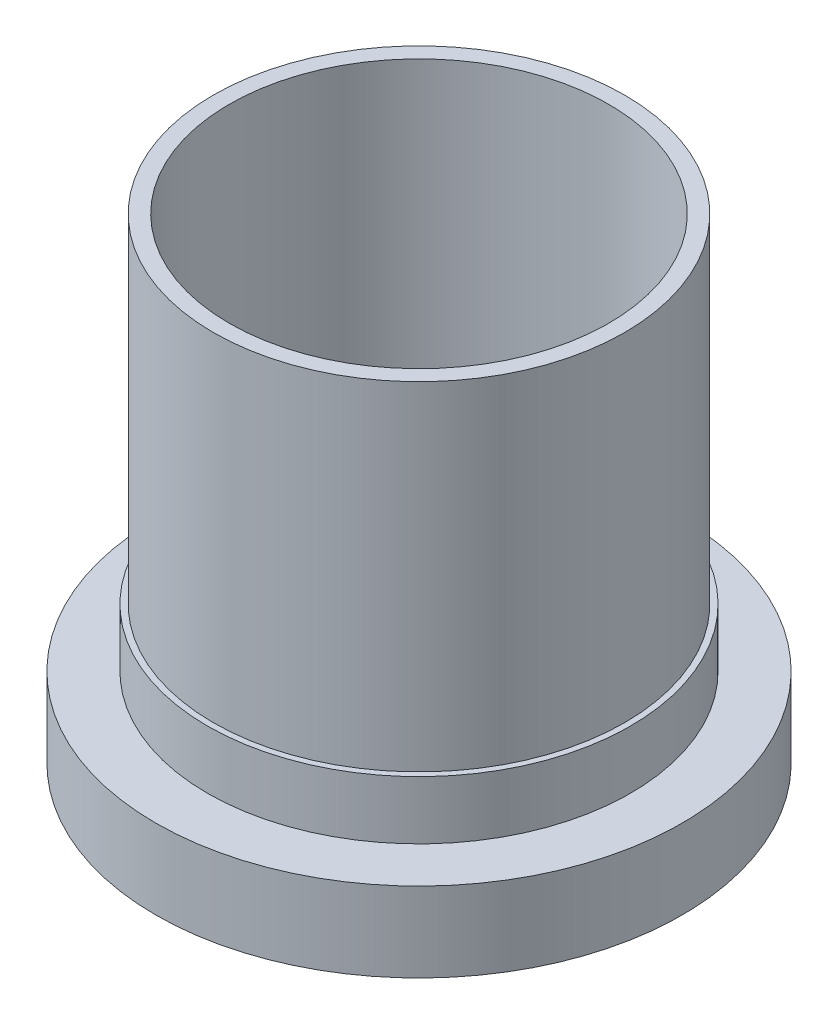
ISO-10303-21;
HEADER;
FILE_DESCRIPTION(('STEP AP214'),'2;1');
FILE_NAME('part.step','',(''),(''),'','','');
FILE_SCHEMA(('AUTOMOTIVE_DESIGN { 1 0 10303 214 1 1 1 1 }'));
ENDSEC;
DATA;
#1=APPLICATION_CONTEXT('core data for automotive mechanical design processes');
#2=APPLICATION_PROTOCOL_DEFINITION('international standard','automotive_design',2000,#1);
#3=PRODUCT_CONTEXT('',#1,'mechanical');
#4=PRODUCT('Part','Part','',(#3));
#5=PRODUCT_RELATED_PRODUCT_CATEGORY('part','',(#4));
#6=PRODUCT_DEFINITION_FORMATION('','',#4);
#7=PRODUCT_DEFINITION_CONTEXT('part definition',#1,'design');
#8=PRODUCT_DEFINITION('design','',#6,#7);
#9=PRODUCT_DEFINITION_SHAPE('','',#8);
#10=(LENGTH_UNIT() NAMED_UNIT(*) SI_UNIT(.MILLI.,.METRE.));
#11=(NAMED_UNIT(*) PLANE_ANGLE_UNIT() SI_UNIT($,.RADIAN.));
#12=(NAMED_UNIT(*) SI_UNIT($,.STERADIAN.) SOLID_ANGLE_UNIT());
#13=UNCERTAINTY_MEASURE_WITH_UNIT(LENGTH_MEASURE(1.E-05),#10,'distance_accuracy_value','');
#14=(GEOMETRIC_REPRESENTATION_CONTEXT(3) GLOBAL_UNCERTAINTY_ASSIGNED_CONTEXT((#13)) GLOBAL_UNIT_ASSIGNED_CONTEXT((#10,
#11,#12)) REPRESENTATION_CONTEXT('',''));
#15=CARTESIAN_POINT('',(0.,0.,0.));
#16=DIRECTION('',(0.,0.,1.));
#17=DIRECTION('',(1.,0.,0.));
#18=AXIS2_PLACEMENT_3D('',#15,#16,#17);
#19=CARTESIAN_POINT('',(-71.0022756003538,39.6268317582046,0.));
#20=DIRECTION('',(0.,1.,0.));
#21=DIRECTION('',(0.,0.,1.));
#22=AXIS2_PLACEMENT_3D('',#19,#20,#21);
#23=CONICAL_SURFACE('',#22,38.,0.848089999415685);
#24=CARTESIAN_POINT('',(-71.0022756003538,45.6120686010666,0.));
#25=DIRECTION('',(0.,1.,0.));
#26=DIRECTION('',(0.,0.,1.));
#27=AXIS2_PLACEMENT_3D('',#24,#25,#26);
#28=CIRCLE('',#27,44.7870026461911);
#29=CARTESIAN_POINT('',(-71.0022756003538,45.6120686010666,44.7870026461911));
#30=VERTEX_POINT('',#29);
#31=EDGE_CURVE('E69',#30,#30,#28,.T.);
#32=ORIENTED_EDGE('',*,*,#31,.T.);
#33=EDGE_LOOP('',(#32));
#34=FACE_BOUND('',#33,.T.);
#35=CARTESIAN_POINT('',(-71.0022756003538,39.6268317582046,0.));
#36=DIRECTION('',(0.,1.,0.));
#37=DIRECTION('',(0.,0.,1.));
#38=AXIS2_PLACEMENT_3D('',#35,#36,#37);
#39=CIRCLE('',#38,38.);
#40=CARTESIAN_POINT('',(-71.0022756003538,39.6268317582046,38.));
#41=VERTEX_POINT('',#40);
#42=EDGE_CURVE('E10',#41,#41,#39,.T.);
#43=ORIENTED_EDGE('',*,*,#42,.F.);
#44=EDGE_LOOP('',(#43));
#45=FACE_BOUND('',#44,.T.);
#46=ADVANCED_FACE('F32',(#34,#45),#23,.F.);
#47=CARTESIAN_POINT('',(-71.0022756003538,158.736724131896,0.));
#48=DIRECTION('',(0.,1.,0.));
#49=DIRECTION('',(0.,0.,1.));
#50=AXIS2_PLACEMENT_3D('',#47,#48,#49);
#51=CYLINDRICAL_SURFACE('',#50,38.);
#52=ORIENTED_EDGE('',*,*,#42,.T.);
#53=EDGE_LOOP('',(#52));
#54=FACE_BOUND('',#53,.T.);
#55=CARTESIAN_POINT('',(-71.0022756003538,29.6268317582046,0.));
#56=DIRECTION('',(0.,1.,0.));
#57=DIRECTION('',(0.,0.,1.));
#58=AXIS2_PLACEMENT_3D('',#55,#56,#57);
#59=CIRCLE('',#58,38.);
#60=CARTESIAN_POINT('',(-71.0022756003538,29.6268317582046,38.));
#61=VERTEX_POINT('',#60);
#62=EDGE_CURVE('E38',#61,#61,#59,.T.);
#63=ORIENTED_EDGE('',*,*,#62,.F.);
#64=EDGE_LOOP('',(#63));
#65=FACE_BOUND('',#64,.T.);
#66=ADVANCED_FACE('F87',(#54,#65),#51,.F.);
#67=CARTESIAN_POINT('',(-109.002275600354,29.6268317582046,0.));
#68=DIRECTION('',(0.,-1.,0.));
#69=DIRECTION('',(0.,0.,-1.));
#70=AXIS2_PLACEMENT_3D('',#67,#68,#69);
#71=PLANE('',#70);
#72=ORIENTED_EDGE('',*,*,#62,.T.);
#73=EDGE_LOOP('',(#72));
#74=FACE_BOUND('',#73,.T.);
#75=CARTESIAN_POINT('',(-71.0022756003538,29.6268317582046,0.));
#76=DIRECTION('',(0.,1.,0.));
#77=DIRECTION('',(0.,0.,1.));
#78=AXIS2_PLACEMENT_3D('',#75,#76,#77);
#79=CIRCLE('',#78,67.75);
#80=CARTESIAN_POINT('',(-71.0022756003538,29.6268317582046,67.75));
#81=VERTEX_POINT('',#80);
#82=EDGE_CURVE('E42',#81,#81,#79,.T.);
#83=ORIENTED_EDGE('',*,*,#82,.F.);
#84=EDGE_LOOP('',(#83));
#85=FACE_BOUND('',#84,.T.);
#86=ADVANCED_FACE('F91',(#74,#85),#71,.T.);
#87=CARTESIAN_POINT('',(-71.0022756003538,158.736724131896,0.));
#88=DIRECTION('',(0.,1.,0.));
#89=DIRECTION('',(0.,0.,1.));
#90=AXIS2_PLACEMENT_3D('',#87,#88,#89);
#91=CYLINDRICAL_SURFACE('',#90,67.75);
#92=ORIENTED_EDGE('',*,*,#82,.T.);
#93=EDGE_LOOP('',(#92));
#94=FACE_BOUND('',#93,.T.);
#95=CARTESIAN_POINT('',(-71.0022756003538,50.1268317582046,0.));
#96=DIRECTION('',(0.,1.,0.));
#97=DIRECTION('',(0.,0.,1.));
#98=AXIS2_PLACEMENT_3D('',#95,#96,#97);
#99=CIRCLE('',#98,67.75);
#100=CARTESIAN_POINT('',(-71.0022756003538,50.1268317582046,67.75));
#101=VERTEX_POINT('',#100);
#102=EDGE_CURVE('E46',#101,#101,#99,.T.);
#103=ORIENTED_EDGE('',*,*,#102,.F.);
#104=EDGE_LOOP('',(#103));
#105=FACE_BOUND('',#104,.T.);
#106=ADVANCED_FACE('F95',(#94,#105),#91,.T.);
#107=CARTESIAN_POINT('',(-138.752275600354,50.1268317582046,0.));
#108=DIRECTION('',(0.,1.,0.));
#109=DIRECTION('',(0.,0.,1.));
#110=AXIS2_PLACEMENT_3D('',#107,#108,#109);
#111=PLANE('',#110);
#112=ORIENTED_EDGE('',*,*,#102,.T.);
#113=EDGE_LOOP('',(#112));
#114=FACE_BOUND('',#113,.T.);
#115=CARTESIAN_POINT('',(-71.0022756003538,50.1268317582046,0.));
#116=DIRECTION('',(0.,1.,0.));
#117=DIRECTION('',(0.,0.,1.));
#118=AXIS2_PLACEMENT_3D('',#115,#116,#117);
#119=CIRCLE('',#118,54.4499999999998);
#120=CARTESIAN_POINT('',(-71.0022756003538,50.1268317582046,54.4499999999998));
#121=VERTEX_POINT('',#120);
#122=EDGE_CURVE('E51',#121,#121,#119,.T.);
#123=ORIENTED_EDGE('',*,*,#122,.F.);
#124=EDGE_LOOP('',(#123));
#125=FACE_BOUND('',#124,.T.);
#126=ADVANCED_FACE('F101',(#114,#125),#111,.T.);
#127=CARTESIAN_POINT('',(-71.0022756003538,158.736724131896,0.));
#128=DIRECTION('',(0.,1.,0.));
#129=DIRECTION('',(0.,0.,1.));
#130=AXIS2_PLACEMENT_3D('',#127,#128,#129);
#131=CYLINDRICAL_SURFACE('',#130,54.4499999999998);
#132=ORIENTED_EDGE('',*,*,#122,.T.);
#133=EDGE_LOOP('',(#132));
#134=FACE_BOUND('',#133,.T.);
#135=CARTESIAN_POINT('',(-71.0022756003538,65.1268317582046,0.));
#136=DIRECTION('',(0.,1.,0.));
#137=DIRECTION('',(0.,0.,1.));
#138=AXIS2_PLACEMENT_3D('',#135,#136,#137);
#139=CIRCLE('',#138,54.4499999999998);
#140=CARTESIAN_POINT('',(-71.0022756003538,65.1268317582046,54.4499999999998));
#141=VERTEX_POINT('',#140);
#142=EDGE_CURVE('E54',#141,#141,#139,.T.);
#143=ORIENTED_EDGE('',*,*,#142,.F.);
#144=EDGE_LOOP('',(#143));
#145=FACE_BOUND('',#144,.T.);
#146=ADVANCED_FACE('F105',(#134,#145),#131,.T.);
#147=CARTESIAN_POINT('',(-123.952275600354,65.1268317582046,0.));
#148=DIRECTION('',(0.,1.,0.));
#149=DIRECTION('',(0.,0.,1.));
#150=AXIS2_PLACEMENT_3D('',#147,#148,#149);
#151=PLANE('',#150);
#152=ORIENTED_EDGE('',*,*,#142,.T.);
#153=EDGE_LOOP('',(#152));
#154=FACE_BOUND('',#153,.T.);
#155=CARTESIAN_POINT('',(-71.0022756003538,65.1268317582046,0.));
#156=DIRECTION('',(0.,1.,0.));
#157=DIRECTION('',(0.,0.,1.));
#158=AXIS2_PLACEMENT_3D('',#155,#156,#157);
#159=CIRCLE('',#158,52.95);
#160=CARTESIAN_POINT('',(-71.0022756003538,65.1268317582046,52.95));
#161=VERTEX_POINT('',#160);
#162=EDGE_CURVE('E57',#161,#161,#159,.T.);
#163=ORIENTED_EDGE('',*,*,#162,.F.);
#164=EDGE_LOOP('',(#163));
#165=FACE_BOUND('',#164,.T.);
#166=ADVANCED_FACE('F109',(#154,#165),#151,.T.);
#167=CARTESIAN_POINT('',(-71.0022756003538,158.736724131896,0.));
#168=DIRECTION('',(0.,1.,0.));
#169=DIRECTION('',(0.,0.,1.));
#170=AXIS2_PLACEMENT_3D('',#167,#168,#169);
#171=CYLINDRICAL_SURFACE('',#170,52.95);
#172=ORIENTED_EDGE('',*,*,#162,.T.);
#173=EDGE_LOOP('',(#172));
#174=FACE_BOUND('',#173,.T.);
#175=CARTESIAN_POINT('',(-71.0022756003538,152.126831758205,0.));
#176=DIRECTION('',(0.,1.,0.));
#177=DIRECTION('',(0.,0.,1.));
#178=AXIS2_PLACEMENT_3D('',#175,#176,#177);
#179=CIRCLE('',#178,52.95);
#180=CARTESIAN_POINT('',(-71.0022756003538,152.126831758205,52.95));
#181=VERTEX_POINT('',#180);
#182=EDGE_CURVE('E60',#181,#181,#179,.T.);
#183=ORIENTED_EDGE('',*,*,#182,.F.);
#184=EDGE_LOOP('',(#183));
#185=FACE_BOUND('',#184,.T.);
#186=ADVANCED_FACE('F113',(#174,#185),#171,.T.);
#187=CARTESIAN_POINT('',(-123.952275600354,152.126831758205,0.));
#188=DIRECTION('',(0.,1.,0.));
#189=DIRECTION('',(0.,0.,1.));
#190=AXIS2_PLACEMENT_3D('',#187,#188,#189);
#191=PLANE('',#190);
#192=ORIENTED_EDGE('',*,*,#182,.T.);
#193=EDGE_LOOP('',(#192));
#194=FACE_BOUND('',#193,.T.);
#195=CARTESIAN_POINT('',(-71.0022756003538,152.126831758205,0.));
#196=DIRECTION('',(0.,1.,0.));
#197=DIRECTION('',(0.,0.,1.));
#198=AXIS2_PLACEMENT_3D('',#195,#196,#197);
#199=CIRCLE('',#198,48.8499999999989);
#200=CARTESIAN_POINT('',(-71.0022756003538,152.126831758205,48.8499999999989));
#201=VERTEX_POINT('',#200);
#202=EDGE_CURVE('E63',#201,#201,#199,.T.);
#203=ORIENTED_EDGE('',*,*,#202,.F.);
#204=EDGE_LOOP('',(#203));
#205=FACE_BOUND('',#204,.T.);
#206=ADVANCED_FACE('F83',(#194,#205),#191,.T.);
#207=CARTESIAN_POINT('',(-71.0022756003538,158.736724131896,0.));
#208=DIRECTION('',(0.,1.,0.));
#209=DIRECTION('',(0.,0.,1.));
#210=AXIS2_PLACEMENT_3D('',#207,#208,#209);
#211=CYLINDRICAL_SURFACE('',#210,48.8499999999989);
#212=ORIENTED_EDGE('',*,*,#202,.T.);
#213=EDGE_LOOP('',(#212));
#214=FACE_BOUND('',#213,.T.);
#215=CARTESIAN_POINT('',(-71.0022756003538,54.6122902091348,0.));
#216=DIRECTION('',(0.,1.,0.));
#217=DIRECTION('',(0.,0.,1.));
#218=AXIS2_PLACEMENT_3D('',#215,#216,#217);
#219=CIRCLE('',#218,48.8499999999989);
#220=CARTESIAN_POINT('',(-71.0022756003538,54.6122902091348,48.8499999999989));
#221=VERTEX_POINT('',#220);
#222=EDGE_CURVE('E66',#221,#221,#219,.T.);
#223=ORIENTED_EDGE('',*,*,#222,.F.);
#224=EDGE_LOOP('',(#223));
#225=FACE_BOUND('',#224,.T.);
#226=ADVANCED_FACE('F77',(#214,#225),#211,.F.);
#227=CARTESIAN_POINT('',(-71.0022756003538,54.6122902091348,0.));
#228=DIRECTION('',(0.,1.,0.));
#229=DIRECTION('',(0.,0.,1.));
#230=AXIS2_PLACEMENT_3D('',#227,#228,#229);
#231=TOROIDAL_SURFACE('',#230,36.8499999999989,12.);
#232=ORIENTED_EDGE('',*,*,#222,.T.);
#233=EDGE_LOOP('',(#232));
#234=FACE_BOUND('',#233,.T.);
#235=ORIENTED_EDGE('',*,*,#31,.F.);
#236=EDGE_LOOP('',(#235));
#237=FACE_BOUND('',#236,.T.);
#238=ADVANCED_FACE('F75',(#234,#237),#231,.F.);
#239=CLOSED_SHELL('',(#46,#66,#86,#106,#126,#146,#166,#186,#206,#226,#238));
#240=MANIFOLD_SOLID_BREP('B2',#239);
#241=ADVANCED_BREP_SHAPE_REPRESENTATION('',(#18,#240),#14);
#242=SHAPE_DEFINITION_REPRESENTATION(#9,#241);
ENDSEC;
END-ISO-10303-21;
